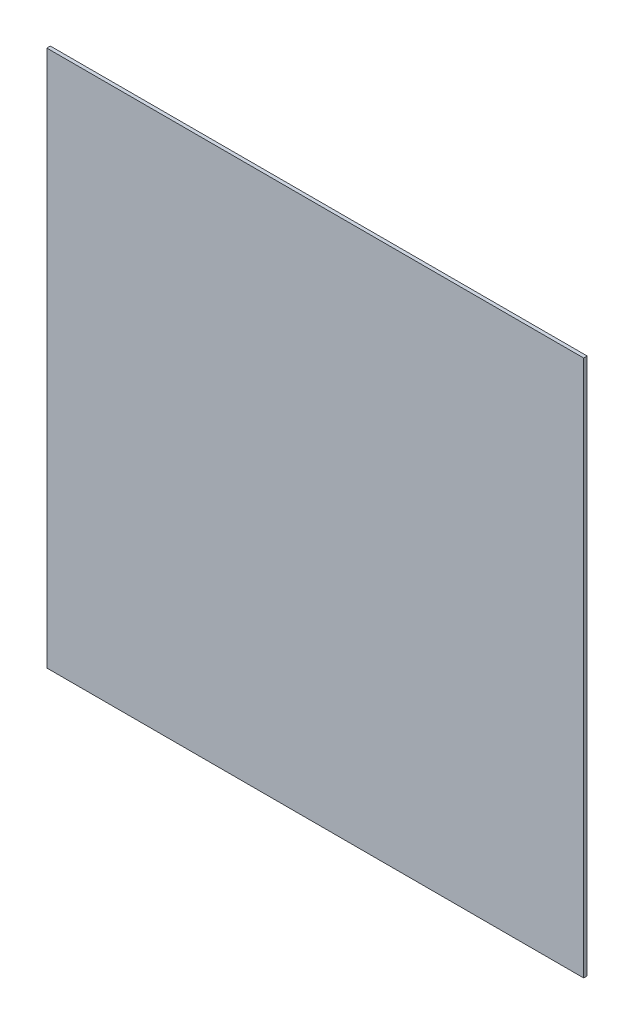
from build123d import *

# Parameters (mm, degrees)
SKETCH1_W           = 1524
SKETCH1_H           = 1524
BOSS_EXTRUDE1_DEPTH = 10


with BuildPart() as part:
    # Sketch1 → Boss-Extrude1 (new body)
    with BuildSketch(Plane.XY):
        with Locations((762, 762)):
            Rectangle(SKETCH1_W, SKETCH1_H)
    extrude(amount=BOSS_EXTRUDE1_DEPTH)


solid = part.part
